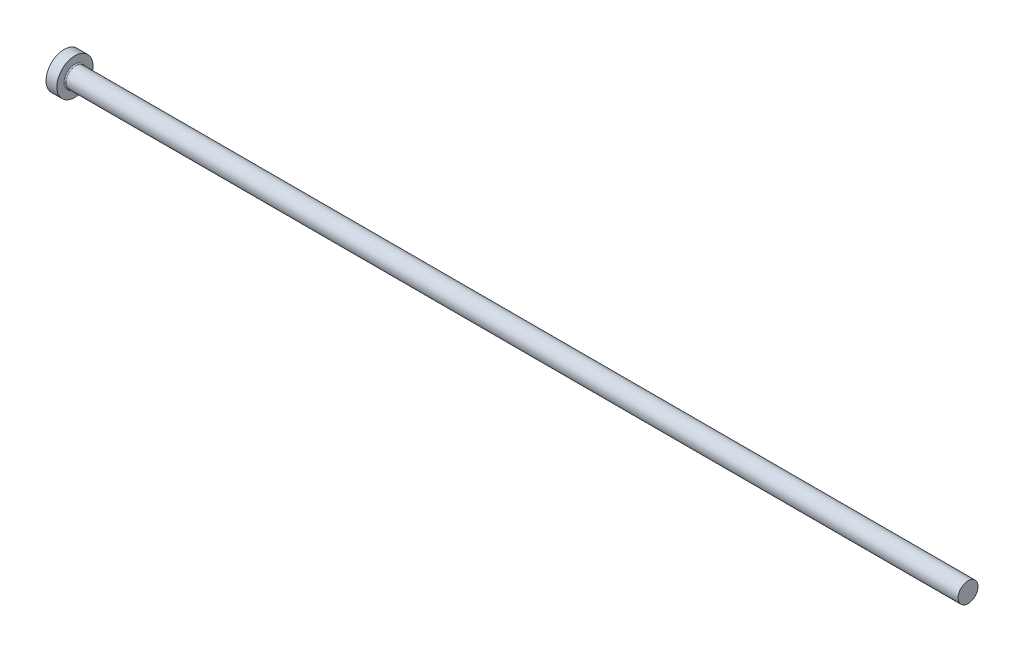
ISO-10303-21;
HEADER;
FILE_DESCRIPTION(('STEP AP214'),'2;1');
FILE_NAME('part.step','',(''),(''),'','','');
FILE_SCHEMA(('AUTOMOTIVE_DESIGN { 1 0 10303 214 1 1 1 1 }'));
ENDSEC;
DATA;
#1=APPLICATION_CONTEXT('core data for automotive mechanical design processes');
#2=APPLICATION_PROTOCOL_DEFINITION('international standard','automotive_design',2000,#1);
#3=PRODUCT_CONTEXT('',#1,'mechanical');
#4=PRODUCT('Part','Part','',(#3));
#5=PRODUCT_RELATED_PRODUCT_CATEGORY('part','',(#4));
#6=PRODUCT_DEFINITION_FORMATION('','',#4);
#7=PRODUCT_DEFINITION_CONTEXT('part definition',#1,'design');
#8=PRODUCT_DEFINITION('design','',#6,#7);
#9=PRODUCT_DEFINITION_SHAPE('','',#8);
#10=(LENGTH_UNIT() NAMED_UNIT(*) SI_UNIT(.MILLI.,.METRE.));
#11=(NAMED_UNIT(*) PLANE_ANGLE_UNIT() SI_UNIT($,.RADIAN.));
#12=(NAMED_UNIT(*) SI_UNIT($,.STERADIAN.) SOLID_ANGLE_UNIT());
#13=UNCERTAINTY_MEASURE_WITH_UNIT(LENGTH_MEASURE(1.E-05),#10,'distance_accuracy_value','');
#14=(GEOMETRIC_REPRESENTATION_CONTEXT(3) GLOBAL_UNCERTAINTY_ASSIGNED_CONTEXT((#13)) GLOBAL_UNIT_ASSIGNED_CONTEXT((#10,
#11,#12)) REPRESENTATION_CONTEXT('',''));
#15=CARTESIAN_POINT('',(0.,0.,0.));
#16=DIRECTION('',(0.,0.,1.));
#17=DIRECTION('',(1.,0.,0.));
#18=AXIS2_PLACEMENT_3D('',#15,#16,#17);
#19=CARTESIAN_POINT('',(0.,0.,0.));
#20=DIRECTION('',(-1.,0.,0.));
#21=DIRECTION('',(0.,-1.,0.));
#22=AXIS2_PLACEMENT_3D('',#19,#20,#21);
#23=PLANE('',#22);
#24=CARTESIAN_POINT('',(0.,0.,0.));
#25=DIRECTION('',(1.,0.,0.));
#26=DIRECTION('',(0.,1.,0.));
#27=AXIS2_PLACEMENT_3D('',#24,#25,#26);
#28=CIRCLE('',#27,5.);
#29=CARTESIAN_POINT('',(0.,5.,0.));
#30=VERTEX_POINT('',#29);
#31=EDGE_CURVE('E25',#30,#30,#28,.T.);
#32=ORIENTED_EDGE('',*,*,#31,.F.);
#33=EDGE_LOOP('',(#32));
#34=FACE_BOUND('',#33,.T.);
#35=ADVANCED_FACE('F14',(#34),#23,.T.);
#36=CARTESIAN_POINT('',(250.,0.,0.));
#37=DIRECTION('',(1.,0.,0.));
#38=DIRECTION('',(0.,1.,0.));
#39=AXIS2_PLACEMENT_3D('',#36,#37,#38);
#40=CYLINDRICAL_SURFACE('',#39,5.);
#41=ORIENTED_EDGE('',*,*,#31,.T.);
#42=EDGE_LOOP('',(#41));
#43=FACE_BOUND('',#42,.T.);
#44=CARTESIAN_POINT('',(3.,0.,0.));
#45=DIRECTION('',(1.,0.,0.));
#46=DIRECTION('',(0.,1.,0.));
#47=AXIS2_PLACEMENT_3D('',#44,#45,#46);
#48=CIRCLE('',#47,5.);
#49=CARTESIAN_POINT('',(3.,5.,0.));
#50=VERTEX_POINT('',#49);
#51=EDGE_CURVE('E29',#50,#50,#48,.T.);
#52=ORIENTED_EDGE('',*,*,#51,.F.);
#53=EDGE_LOOP('',(#52));
#54=FACE_BOUND('',#53,.T.);
#55=ADVANCED_FACE('F51',(#43,#54),#40,.T.);
#56=CARTESIAN_POINT('',(3.,5.,0.));
#57=DIRECTION('',(1.,0.,0.));
#58=DIRECTION('',(0.,1.,0.));
#59=AXIS2_PLACEMENT_3D('',#56,#57,#58);
#60=PLANE('',#59);
#61=CARTESIAN_POINT('',(3.,0.,0.));
#62=DIRECTION('',(1.,0.,0.));
#63=DIRECTION('',(0.,1.,0.));
#64=AXIS2_PLACEMENT_3D('',#61,#62,#63);
#65=CIRCLE('',#64,3.04999999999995);
#66=CARTESIAN_POINT('',(3.,3.04999999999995,0.));
#67=VERTEX_POINT('',#66);
#68=EDGE_CURVE('E9',#67,#67,#65,.F.);
#69=ORIENTED_EDGE('',*,*,#68,.T.);
#70=EDGE_LOOP('',(#69));
#71=FACE_BOUND('',#70,.T.);
#72=ORIENTED_EDGE('',*,*,#51,.T.);
#73=EDGE_LOOP('',(#72));
#74=FACE_BOUND('',#73,.T.);
#75=ADVANCED_FACE('F42',(#71,#74),#60,.T.);
#76=CARTESIAN_POINT('',(250.,0.,0.));
#77=DIRECTION('',(1.,0.,0.));
#78=DIRECTION('',(0.,1.,0.));
#79=AXIS2_PLACEMENT_3D('',#76,#77,#78);
#80=CYLINDRICAL_SURFACE('',#79,2.74999999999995);
#81=CARTESIAN_POINT('',(3.3,0.,0.));
#82=DIRECTION('',(1.,0.,0.));
#83=DIRECTION('',(0.,1.,0.));
#84=AXIS2_PLACEMENT_3D('',#81,#82,#83);
#85=CIRCLE('',#84,2.74999999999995);
#86=CARTESIAN_POINT('',(3.3,2.74999999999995,0.));
#87=VERTEX_POINT('',#86);
#88=EDGE_CURVE('E21',#87,#87,#85,.T.);
#89=ORIENTED_EDGE('',*,*,#88,.T.);
#90=EDGE_LOOP('',(#89));
#91=FACE_BOUND('',#90,.T.);
#92=CARTESIAN_POINT('',(250.,0.,0.));
#93=DIRECTION('',(1.,0.,0.));
#94=DIRECTION('',(0.,1.,0.));
#95=AXIS2_PLACEMENT_3D('',#92,#93,#94);
#96=CIRCLE('',#95,2.75);
#97=CARTESIAN_POINT('',(250.,2.75000000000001,0.));
#98=VERTEX_POINT('',#97);
#99=EDGE_CURVE('E34',#98,#98,#96,.T.);
#100=ORIENTED_EDGE('',*,*,#99,.F.);
#101=EDGE_LOOP('',(#100));
#102=FACE_BOUND('',#101,.T.);
#103=ADVANCED_FACE('F40',(#91,#102),#80,.T.);
#104=CARTESIAN_POINT('',(250.,2.75,0.));
#105=DIRECTION('',(1.,0.,0.));
#106=DIRECTION('',(0.,1.,0.));
#107=AXIS2_PLACEMENT_3D('',#104,#105,#106);
#108=PLANE('',#107);
#109=ORIENTED_EDGE('',*,*,#99,.T.);
#110=EDGE_LOOP('',(#109));
#111=FACE_BOUND('',#110,.T.);
#112=ADVANCED_FACE('F38',(#111),#108,.T.);
#113=CARTESIAN_POINT('',(3.3,0.,0.));
#114=DIRECTION('',(1.,0.,0.));
#115=DIRECTION('',(0.,1.,0.));
#116=AXIS2_PLACEMENT_3D('',#113,#114,#115);
#117=TOROIDAL_SURFACE('',#116,3.04999999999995,0.3);
#118=ORIENTED_EDGE('',*,*,#68,.F.);
#119=EDGE_LOOP('',(#118));
#120=FACE_BOUND('',#119,.T.);
#121=ORIENTED_EDGE('',*,*,#88,.F.);
#122=EDGE_LOOP('',(#121));
#123=FACE_BOUND('',#122,.T.);
#124=ADVANCED_FACE('F16',(#120,#123),#117,.F.);
#125=CLOSED_SHELL('',(#35,#55,#75,#103,#112,#124));
#126=MANIFOLD_SOLID_BREP('B1',#125);
#127=ADVANCED_BREP_SHAPE_REPRESENTATION('',(#18,#126),#14);
#128=SHAPE_DEFINITION_REPRESENTATION(#9,#127);
ENDSEC;
END-ISO-10303-21;
